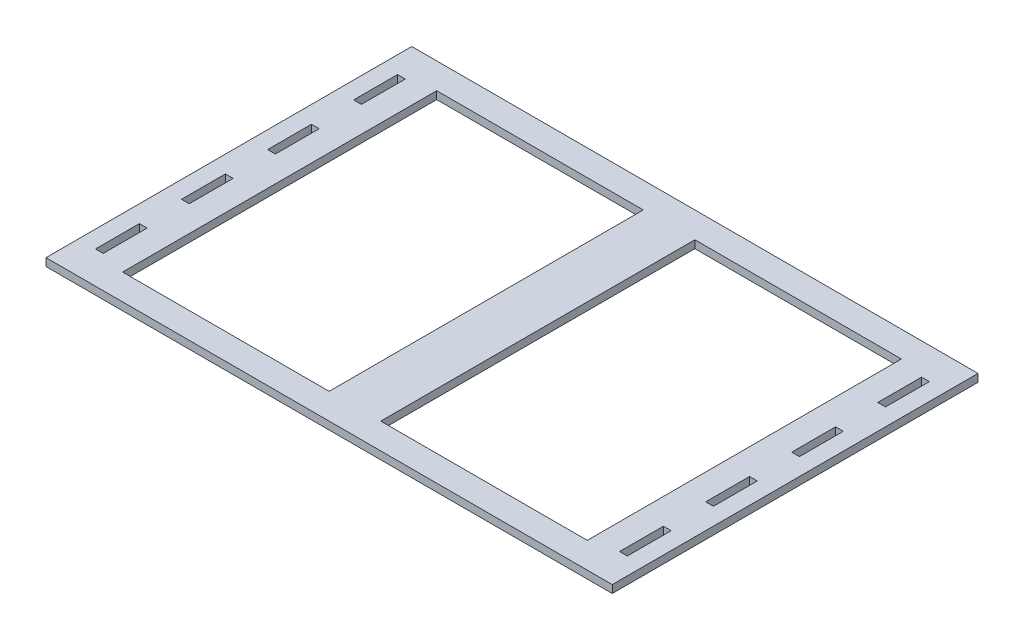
from build123d import *

# Parameters (mm, degrees)
SKETCH1_W           = 658
SKETCH1_H           = 425
BOSS_EXTRUDE1_DEPTH = 9
SKETCH2_W           = 9
SKETCH2_H           = 51
CUT_EXTRUDE3_DEPTH  = 392.763002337
LPATTERN1_COUNT     = 4
LPATTERN1_PITCH     = 100
SKETCH3_W           = 9
SKETCH3_H           = 51
CUT_EXTRUDE4_DEPTH  = 392.763002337
LPATTERN2_COUNT     = 4
LPATTERN2_PITCH     = 100
SKETCH4_W           = 240
SKETCH4_H           = 365
CUT_EXTRUDE6_DEPTH  = 392.763002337
LPATTERN3_COUNT     = 2
LPATTERN3_PITCH     = 300


with BuildPart() as part:
    # Sketch1 → Boss-Extrude1 (new body)
    with BuildSketch(Plane(origin=(0, 0, 0), x_dir=(1, 0, 0), z_dir=(0, 1, 0))):
        Rectangle(SKETCH1_W, SKETCH1_H)
    extrude(amount=BOSS_EXTRUDE1_DEPTH)

    # Sketch2 → Cut-Extrude3 (cut, through all)
    with BuildSketch(Plane(origin=(0, 0, 0), x_dir=(1, 0, 0), z_dir=(0, 1, 0))):
        with Locations((304.5, 150.5)):
            Rectangle(SKETCH2_W, SKETCH2_H)
    cut_extrude3 = extrude(amount=CUT_EXTRUDE3_DEPTH, mode=Mode.SUBTRACT)

    # LPattern1: Cut-Extrude3 ×4
    with Locations(*[(0, 0, i * LPATTERN1_PITCH) for i in range(1, LPATTERN1_COUNT)]):
        add(cut_extrude3, mode=Mode.SUBTRACT)

    # Sketch3 → Cut-Extrude4 (cut, through all)
    with BuildSketch(Plane(origin=(0, 9, 0), x_dir=(1, 0, 0), z_dir=(0, 1, 0))):
        with Locations((-304.5, 150.5)):
            Rectangle(SKETCH3_W, SKETCH3_H)
    cut_extrude4 = extrude(amount=-CUT_EXTRUDE4_DEPTH, mode=Mode.SUBTRACT)

    # LPattern2: Cut-Extrude4 ×4
    with Locations(*[(0, 0, i * LPATTERN2_PITCH) for i in range(1, LPATTERN2_COUNT)]):
        add(cut_extrude4, mode=Mode.SUBTRACT)

    # Sketch4 → Cut-Extrude6 (cut, through all)
    with BuildSketch(Plane(origin=(0, 0, 0), x_dir=(1, 0, 0), z_dir=(0, 1, 0))):
        with Locations((-150, 0)):
            Rectangle(SKETCH4_W, SKETCH4_H)
    cut_extrude6 = extrude(amount=CUT_EXTRUDE6_DEPTH, mode=Mode.SUBTRACT)

    # LPattern3: Cut-Extrude6 ×2
    with Locations(*[(i * LPATTERN3_PITCH, 0, 0) for i in range(1, LPATTERN3_COUNT)]):
        add(cut_extrude6, mode=Mode.SUBTRACT)


solid = part.part
